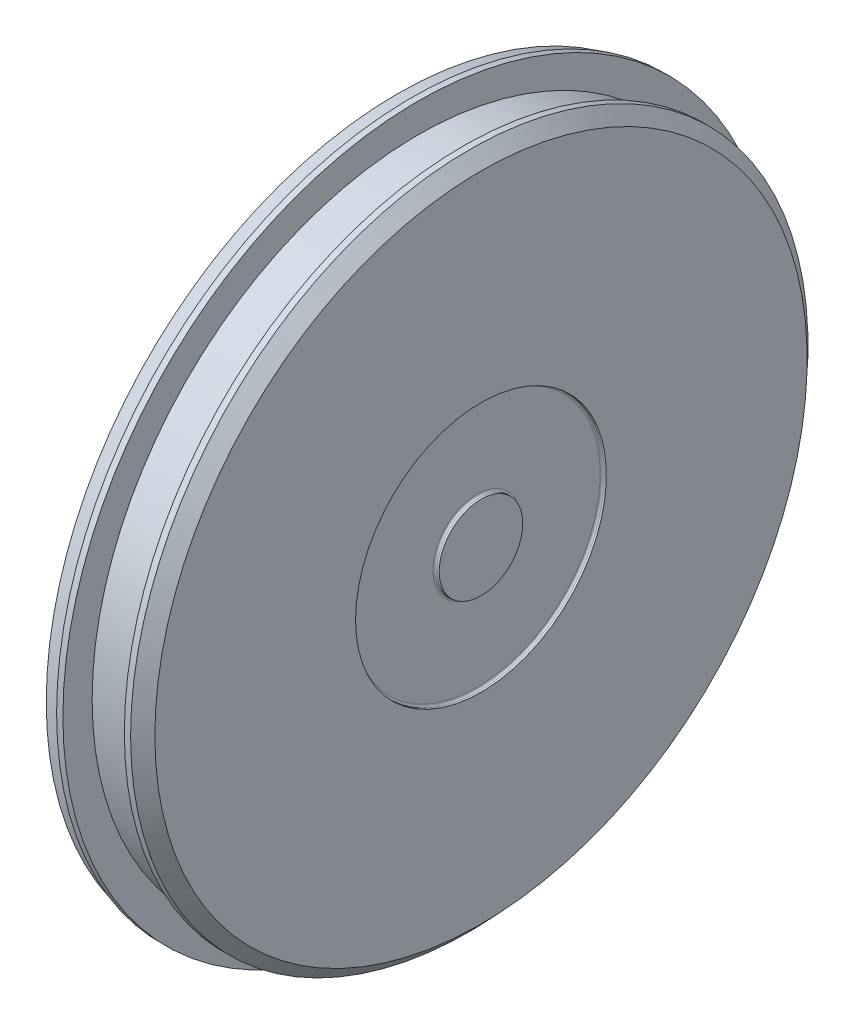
from build123d import *

# Parameters (mm, degrees)
ESQUISSE2_R             = 4
ENL_V_MAT_EXTRU_1_DEPTH = 20


with BuildPart() as part:
    # Esquisse1 → Base-R_volution (revolve)
    with BuildSketch(Plane.XY, mode=Mode.PRIVATE) as base_r_volution_sk:
        with BuildLine():
            Line((-52.75, 9), (-26, 9))
            ThreePointArc((-26, 9), (-25.292893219, 8.707106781), (-25, 8))
            Line((-25, 8), (-25, 0))
            Line((-25, 0), (-19, 0))
            Line((-19, 0), (-19, 10))
            Line((-19, 10), (-19.5, 10))
            ThreePointArc((-19.5, 10), (-19.853553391, 10.146446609), (-20, 10.5))
            Line((-20, 10.5), (-20, 29.5))
            ThreePointArc((-20, 29.5), (-19.853553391, 29.853553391), (-19.5, 30))
            Line((-19.5, 30), (-19, 30))
            Line((-19, 30), (-19, 78))
            Line((-19, 78), (-21.8, 81))
            Line((-21.8, 81), (-23.3, 81))
            Line((-23.3, 81), (-23.3, 78))
            Line((-23.3, 78), (-34, 78))
            Line((-34, 78), (-34, 85))
            Line((-34, 85), (-35.5, 85))
            ThreePointArc((-35.5, 85), (-37.255307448, 84.505595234), (-39, 83.974946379))
            Line((-39, 83.974946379), (-39, 76.64))
            ThreePointArc((-39, 76.64), (-38.121320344, 74.518679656), (-36, 73.64))
            Line((-36, 73.64), (-29, 73.64))
            ThreePointArc((-29, 73.64), (-26.878679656, 72.761320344), (-26, 70.64))
            Line((-26, 70.64), (-26, 51))
            ThreePointArc((-26, 51), (-26.878679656, 48.878679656), (-29, 48))
            Line((-29, 48), (-30, 48))
            ThreePointArc((-30, 48), (-32.121320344, 47.121320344), (-33, 45))
            Line((-33, 45), (-33, 36))
            ThreePointArc((-33, 36), (-32.121320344, 33.878679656), (-30, 33))
            Line((-30, 33), (-28.467290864, 33))
            ThreePointArc((-28.467290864, 33), (-25.97676507, 31.672507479), (-25.690342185, 28.864854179))
            Line((-25.690342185, 28.864854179), (-29.873844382, 18.630599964))
            ThreePointArc((-29.873844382, 18.630599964), (-31.461186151, 16.39906567), (-33.874827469, 15.105336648))
            Line((-33.874827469, 15.105336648), (-38, 14))
            Line((-38, 14), (-56, 14))
            Line((-56, 14), (-56, 9.25))
            Line((-56, 9.25), (-53, 9.25))
            Line((-53, 9.25), (-52.75, 9))
        make_face()
    revolve(base_r_volution_sk.sketch.rotate(Axis((-110, 0, 0), (1, 0, 0)), 90), axis=Axis((-110, 0, 0), (1, 0, 0)))

    # Esquisse2 → Enl_v. mat.-Extru.1 (cut, symmetric)
    with BuildSketch(Plane.XY):
        with Locations((-44, 0)):
            Circle(ESQUISSE2_R)
    extrude(amount=ENL_V_MAT_EXTRU_1_DEPTH, both=True, mode=Mode.SUBTRACT)


solid = part.part
